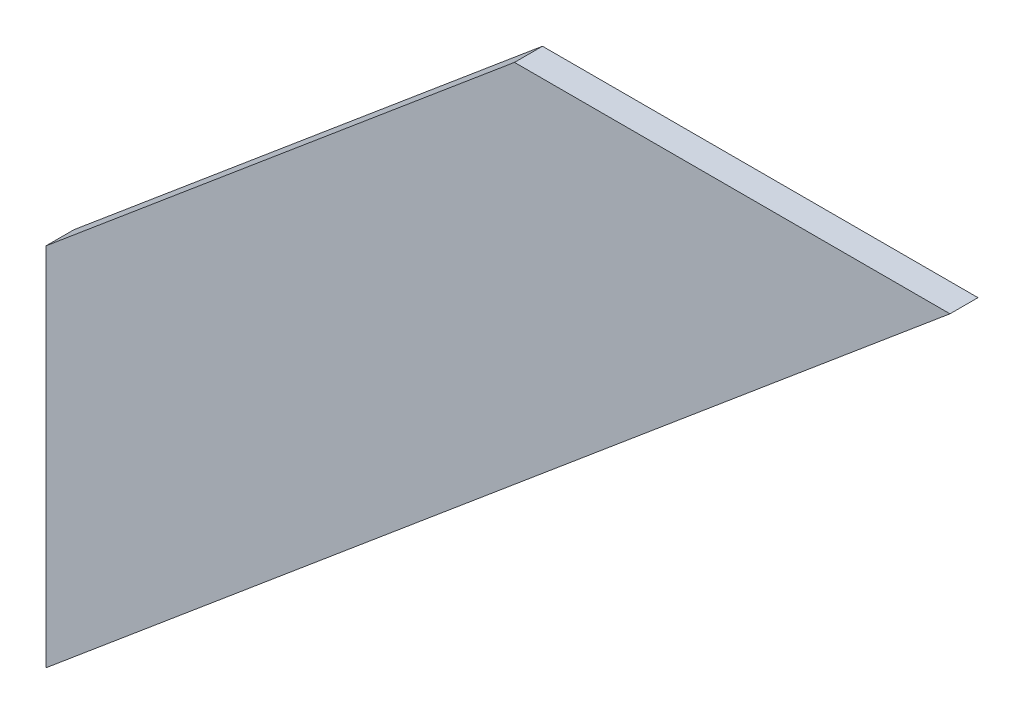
from build123d import *

# Parameters (mm, degrees)
AUFSATZ_LINEAR_AUSTRAGEN1_DEPTH = 8


with BuildPart() as part:
    # Skizze1 → Aufsatz-Linear austragen1 (new body)
    with BuildSketch(Plane.XY):
        Polygon((-2520, 1057.661896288), (-2386.120661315, 1170), (-2261.662755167, 1170), (-2520, 953.229313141), align=None)
    extrude(amount=AUFSATZ_LINEAR_AUSTRAGEN1_DEPTH)


solid = part.part
